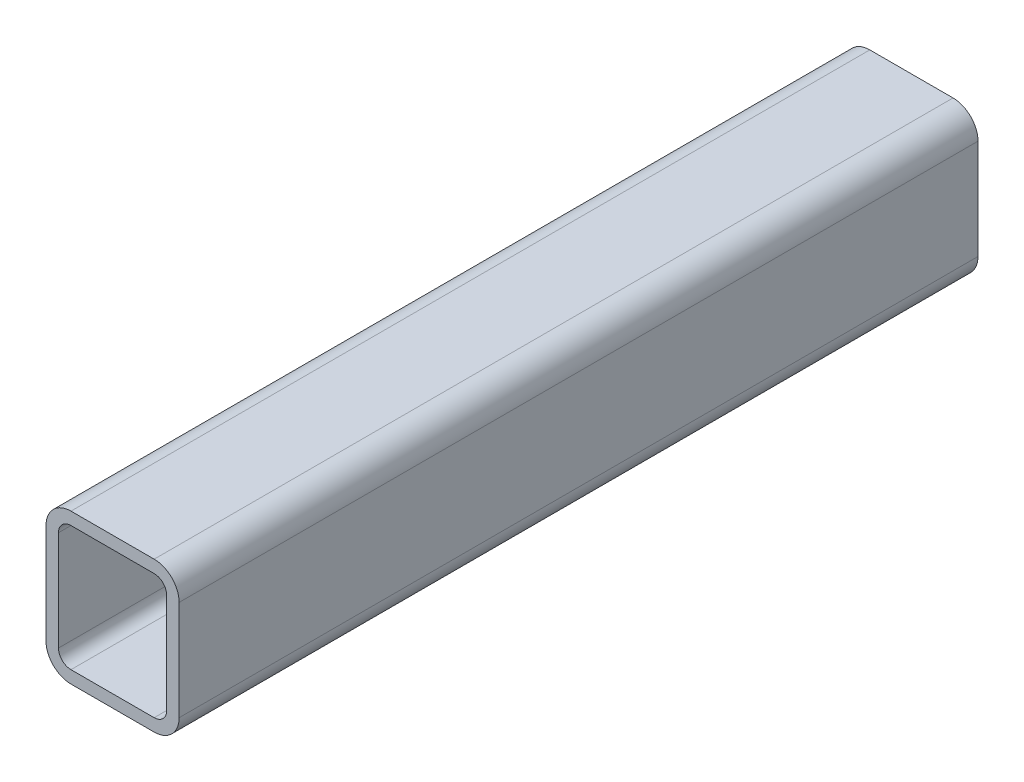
from build123d import *

# Parameters (mm, degrees)
BOSS_EXTRUDE1_DEPTH = 304.8


with BuildPart() as part:
    # Sketch1 → Boss-Extrude1 (new body)
    with BuildSketch(Plane.XY):
        with BuildLine():
            Line((9.525, 57.15), (41.275, 57.15))
            ThreePointArc((41.275, 57.15), (48.010192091, 54.360192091), (50.8, 47.625))
            Line((50.8, 47.625), (50.8, 9.525))
            ThreePointArc((50.8, 9.525), (48.010192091, 2.789807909), (41.275, 0))
            Line((41.275, 0), (9.525, 0))
            ThreePointArc((9.525, 0), (2.789807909, 2.789807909), (0, 9.525))
            Line((0, 9.525), (0, 47.625))
            ThreePointArc((0, 47.625), (2.789807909, 54.360192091), (9.525, 57.15))
        make_face()
        with BuildLine():
            Line((9.525, 52.3875), (41.275, 52.3875))
            ThreePointArc((41.275, 52.3875), (44.642596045, 50.992596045), (46.0375, 47.625))
            Line((46.0375, 47.625), (46.0375, 9.525))
            ThreePointArc((46.0375, 9.525), (44.642596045, 6.157403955), (41.275, 4.7625))
            Line((41.275, 4.7625), (9.525, 4.7625))
            ThreePointArc((9.525, 4.7625), (6.157403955, 6.157403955), (4.7625, 9.525))
            Line((4.7625, 9.525), (4.7625, 47.625))
            ThreePointArc((4.7625, 47.625), (6.157403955, 50.992596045), (9.525, 52.3875))
        make_face(mode=Mode.SUBTRACT)
    extrude(amount=BOSS_EXTRUDE1_DEPTH)


solid = part.part
